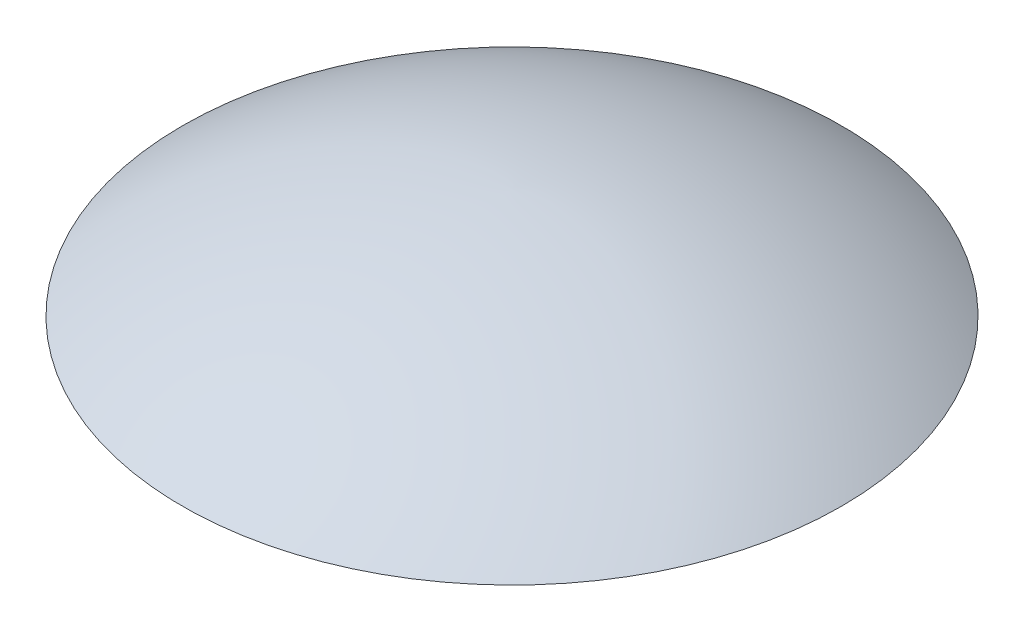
from build123d import *

# Parameters (mm, degrees)
SHELL3_T = -3


with BuildPart() as part:
    # Sketch1 → Revolve2 (revolve)
    with BuildSketch(Plane.XY):
        with BuildLine():
            Line((0, 20), (0, 0))
            Line((0, 0), (-60, 0))
            ThreePointArc((-60, 0), (-31.512378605, 14.537135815), (0, 20))
        make_face()
    revolve(axis=Axis((0, 20, 0), (0, -1, 0)))

    # Shell3
    shell3_openings = [part.faces().sort_by_distance(p)[0] for p in [
        (0, 0, 0),
    ]]
    offset(amount=SHELL3_T, openings=shell3_openings)


solid = part.part
